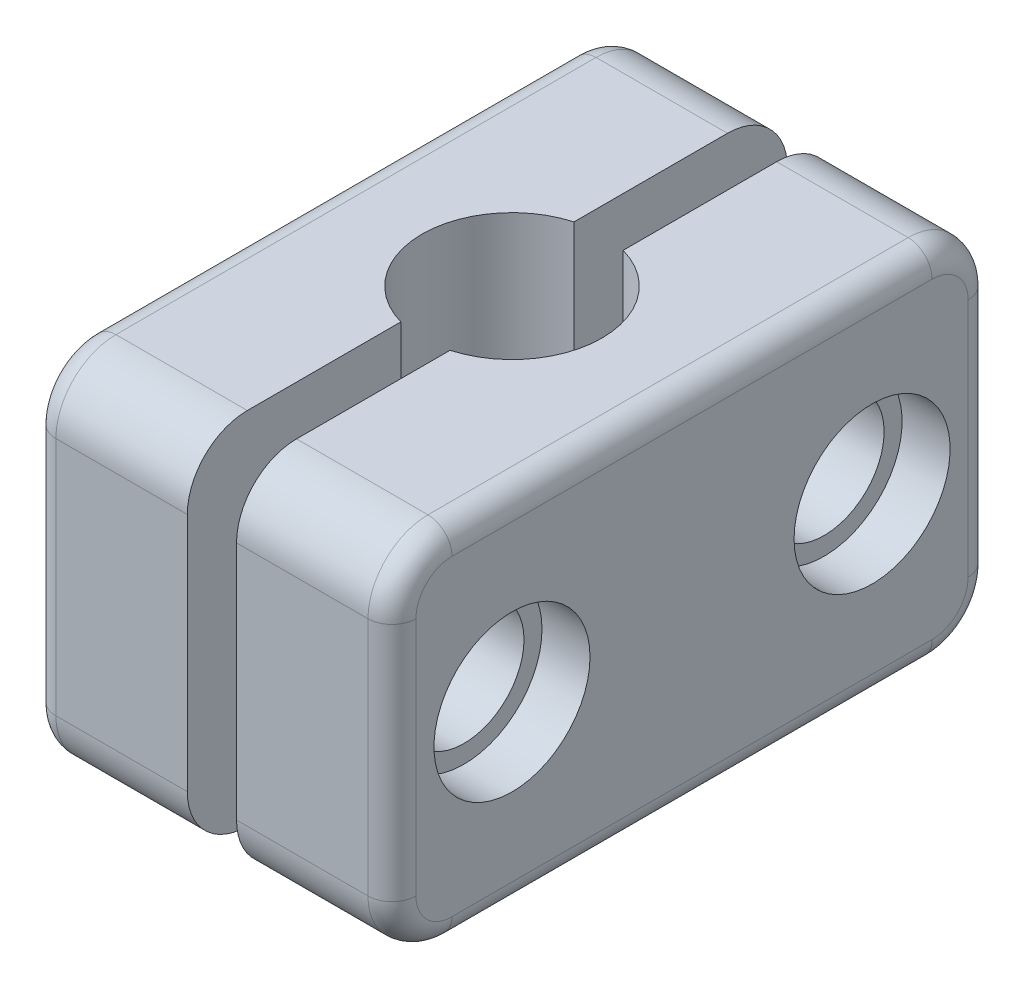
from build123d import *

# Parameters (mm, degrees)
SKETCH1_R           = 5
BOSS_EXTRUDE1_DEPTH = 15
FILLET1_R           = 2
SKETCH2_R           = 6.5
CUT_EXTRUDE1_DEPTH  = 4
CUT_EXTRUDE4_DEPTH  = 80


with BuildPart() as part:
    # Sketch1 → Boss-Extrude1 (new, symmetric)
    with BuildSketch(Plane(origin=(0, 0, 0), x_dir=(0, 0, -1), z_dir=(1, 0, 0))):
        with BuildLine():
            Line((-20, 15), (20, 15))
            ThreePointArc((20, 15), (23.535533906, 13.535533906), (25, 10))
            Line((25, 10), (25, -10))
            ThreePointArc((25, -10), (23.535533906, -13.535533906), (20, -15))
            Line((20, -15), (-20, -15))
            ThreePointArc((-20, -15), (-23.535533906, -13.535533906), (-25, -10))
            Line((-25, -10), (-25, 10))
            ThreePointArc((-25, 10), (-23.535533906, 13.535533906), (-20, 15))
        make_face()
        with Locations((-15, 0)):
            Circle(SKETCH1_R, mode=Mode.SUBTRACT)
        with Locations(Location((15, 0, 0), (0, 0, 180))):
            Circle(SKETCH1_R, mode=Mode.SUBTRACT)
    extrude(amount=BOSS_EXTRUDE1_DEPTH, both=True)

    # Fillet1
    fillet1_edges = [part.edges().sort_by_distance(p)[0] for p in [
        (15, 13.535533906, 23.535533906),
        (-15, 15, 0),
        (-15, 13.535533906, -23.535533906),
        (15, 0, 25),
        (15, -13.535533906, 23.535533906),
        (15, -15, 0),
        (15, -13.535533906, -23.535533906),
        (15, 0, -25),
        (15, 13.535533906, -23.535533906),
        (15, 15, 0),
        (-15, 0, -25),
        (-15, -13.535533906, -23.535533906),
        (-15, -15, 0),
        (-15, -13.535533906, 23.535533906),
        (-15, 0, 25),
        (-15, 13.535533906, 23.535533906),
    ]]
    fillet(fillet1_edges, radius=FILLET1_R)

    # Sketch2 → Cut-Extrude1 (cut)
    with BuildSketch(Plane(origin=(15, 0, 0), x_dir=(0, 0, -1), z_dir=(1, 0, 0))):
        with Locations((-15, 0)):
            Circle(SKETCH2_R)
        with Locations(Location((15, 0, 0), (0, 0, 180))):
            Circle(SKETCH2_R)
    cut_extrude1 = extrude(amount=-CUT_EXTRUDE1_DEPTH, mode=Mode.SUBTRACT)

    # Mirror1: Cut-Extrude1 across plane
    add(cut_extrude1.mirror(Plane(origin=(0, 0, 0), x_dir=(0, 0, 1), z_dir=(1, 0, 0))), mode=Mode.SUBTRACT)

    # Sketch3 → Cut-Extrude4 (cut)
    with BuildSketch(Plane(origin=(0, 15, 0), x_dir=(1, 0, 0), z_dir=(0, 1, 0))):
        with BuildLine():
            Line((-2.05, -7.214395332), (-2.05, -38.051862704))
            Line((-2.05, -38.051862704), (2.05, -38.051862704))
            Line((2.05, -38.051862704), (2.05, -7.214395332))
            ThreePointArc((2.05, -7.214395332), (7.5, 0), (2.05, 7.214395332))
            Line((2.05, 7.214395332), (2.05, 38.051862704))
            Line((2.05, 38.051862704), (-2.05, 38.051862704))
            Line((-2.05, 38.051862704), (-2.05, 7.214395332))
            ThreePointArc((-2.05, 7.214395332), (-7.5, 0), (-2.05, -7.214395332))
        make_face()
    extrude(amount=-CUT_EXTRUDE4_DEPTH, mode=Mode.SUBTRACT)


with BuildPart() as cut_extrude4_piece_1:
    # of the separate pieces the step leaves, piece 1, a body of its own (cut_extrude4_pieces)
    add(part.part.solids().sort_by_distance((-13, 15, 20))[0])


with BuildPart() as cut_extrude4_piece_2:
    # of the separate pieces the step leaves, piece 2, a body of its own (cut_extrude4_pieces)
    add(part.part.solids().sort_by_distance((2.05, 15, 20))[0])


solid = Compound([cut_extrude4_piece_1.part, cut_extrude4_piece_2.part])
